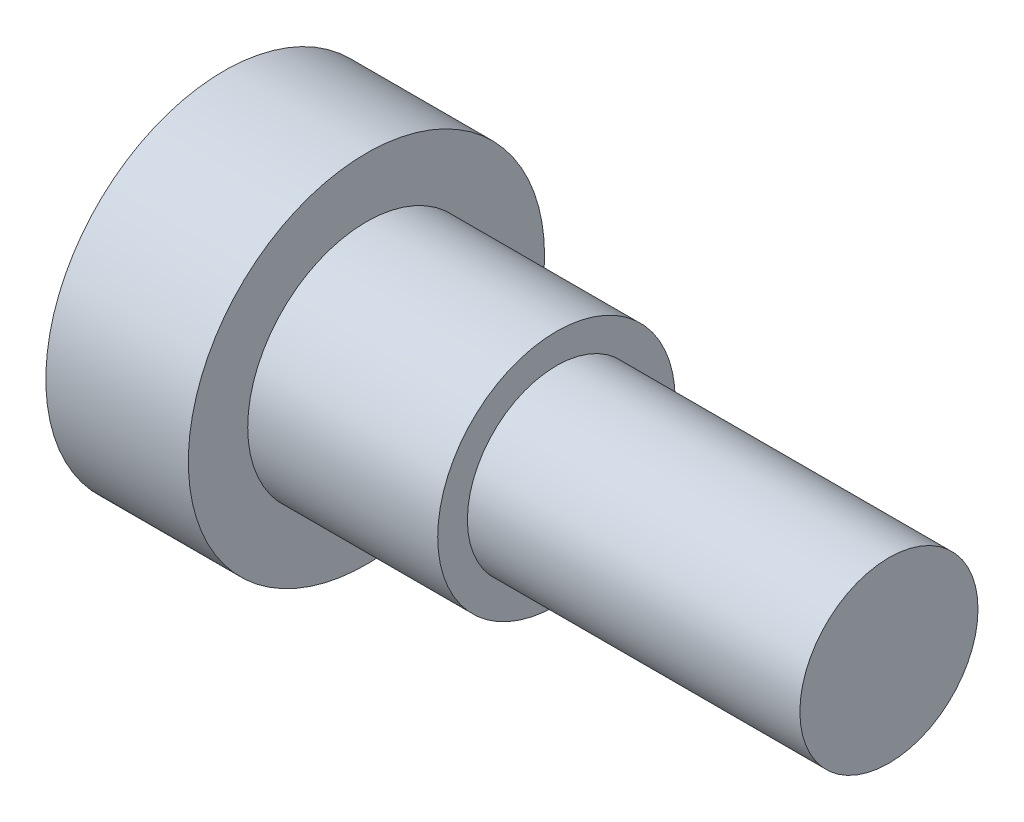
from build123d import *


with BuildPart() as part:
    # Szkic1 → Obr_t1 (revolve)
    with BuildSketch(Plane.XY, mode=Mode.PRIVATE) as obr_t1_sk:
        Polygon((0, 0), (0, 37.5), (30, 37.5), (30, 25), (70, 25), (70, 18.75), (140, 18.75), (140, 0), align=None)
    revolve(obr_t1_sk.sketch.rotate(Axis((0, 0, 0), (-1, 0, 0)), 90), axis=Axis((0, 0, 0), (-1, 0, 0)))


solid = part.part
